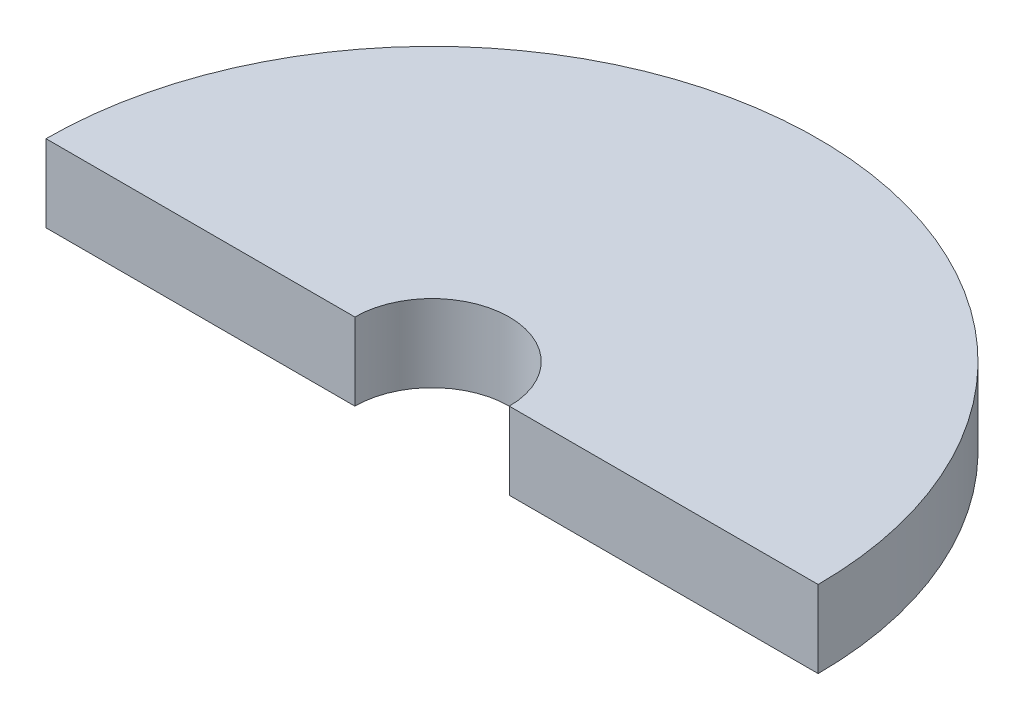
ISO-10303-21;
HEADER;
FILE_DESCRIPTION(('STEP AP214'),'2;1');
FILE_NAME('part.step','',(''),(''),'','','');
FILE_SCHEMA(('AUTOMOTIVE_DESIGN { 1 0 10303 214 1 1 1 1 }'));
ENDSEC;
DATA;
#1=APPLICATION_CONTEXT('core data for automotive mechanical design processes');
#2=APPLICATION_PROTOCOL_DEFINITION('international standard','automotive_design',2000,#1);
#3=PRODUCT_CONTEXT('',#1,'mechanical');
#4=PRODUCT('Part','Part','',(#3));
#5=PRODUCT_RELATED_PRODUCT_CATEGORY('part','',(#4));
#6=PRODUCT_DEFINITION_FORMATION('','',#4);
#7=PRODUCT_DEFINITION_CONTEXT('part definition',#1,'design');
#8=PRODUCT_DEFINITION('design','',#6,#7);
#9=PRODUCT_DEFINITION_SHAPE('','',#8);
#10=(LENGTH_UNIT() NAMED_UNIT(*) SI_UNIT(.MILLI.,.METRE.));
#11=(NAMED_UNIT(*) PLANE_ANGLE_UNIT() SI_UNIT($,.RADIAN.));
#12=(NAMED_UNIT(*) SI_UNIT($,.STERADIAN.) SOLID_ANGLE_UNIT());
#13=UNCERTAINTY_MEASURE_WITH_UNIT(LENGTH_MEASURE(1.E-05),#10,'distance_accuracy_value','');
#14=(GEOMETRIC_REPRESENTATION_CONTEXT(3) GLOBAL_UNCERTAINTY_ASSIGNED_CONTEXT((#13)) GLOBAL_UNIT_ASSIGNED_CONTEXT((#10,
#11,#12)) REPRESENTATION_CONTEXT('',''));
#15=CARTESIAN_POINT('',(0.,0.,0.));
#16=DIRECTION('',(0.,0.,1.));
#17=DIRECTION('',(1.,0.,0.));
#18=AXIS2_PLACEMENT_3D('',#15,#16,#17);
#19=CARTESIAN_POINT('',(0.,1.,0.));
#20=DIRECTION('',(0.,1.,0.));
#21=DIRECTION('',(0.,0.,1.));
#22=AXIS2_PLACEMENT_3D('',#19,#20,#21);
#23=PLANE('',#22);
#24=CARTESIAN_POINT('',(0.,1.,0.));
#25=DIRECTION('',(0.,1.,0.));
#26=DIRECTION('',(0.,0.,1.));
#27=AXIS2_PLACEMENT_3D('',#24,#25,#26);
#28=CIRCLE('',#27,5.);
#29=CARTESIAN_POINT('',(5.,1.,0.));
#30=VERTEX_POINT('',#29);
#31=CARTESIAN_POINT('',(-4.99999999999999,1.,0.));
#32=VERTEX_POINT('',#31);
#33=EDGE_CURVE('E85',#30,#32,#28,.T.);
#34=ORIENTED_EDGE('',*,*,#33,.T.);
#35=DIRECTION('',(1.,0.,0.));
#36=VECTOR('',#35,1.);
#37=CARTESIAN_POINT('',(0.,1.,0.));
#38=LINE('',#37,#36);
#39=CARTESIAN_POINT('',(-1.,1.,0.));
#40=VERTEX_POINT('',#39);
#41=EDGE_CURVE('E100',#32,#40,#38,.T.);
#42=ORIENTED_EDGE('',*,*,#41,.T.);
#43=CARTESIAN_POINT('',(0.,1.,0.));
#44=DIRECTION('',(0.,1.,0.));
#45=DIRECTION('',(0.,0.,1.));
#46=AXIS2_PLACEMENT_3D('',#43,#44,#45);
#47=CIRCLE('',#46,1.);
#48=CARTESIAN_POINT('',(1.,1.,0.));
#49=VERTEX_POINT('',#48);
#50=EDGE_CURVE('E88',#49,#40,#47,.T.);
#51=ORIENTED_EDGE('',*,*,#50,.F.);
#52=EDGE_CURVE('E53',#49,#30,#38,.T.);
#53=ORIENTED_EDGE('',*,*,#52,.T.);
#54=EDGE_LOOP('',(#34,#42,#51,#53));
#55=FACE_BOUND('',#54,.T.);
#56=ADVANCED_FACE('F31',(#55),#23,.T.);
#57=CARTESIAN_POINT('',(0.,0.,0.));
#58=DIRECTION('',(0.,1.,0.));
#59=DIRECTION('',(0.,0.,1.));
#60=AXIS2_PLACEMENT_3D('',#57,#58,#59);
#61=PLANE('',#60);
#62=DIRECTION('',(-1.,0.,0.));
#63=VECTOR('',#62,1.);
#64=CARTESIAN_POINT('',(0.,0.,0.));
#65=LINE('',#64,#63);
#66=CARTESIAN_POINT('',(-1.,0.,0.));
#67=VERTEX_POINT('',#66);
#68=CARTESIAN_POINT('',(-4.99999999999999,0.,0.));
#69=VERTEX_POINT('',#68);
#70=EDGE_CURVE('E46',#67,#69,#65,.T.);
#71=ORIENTED_EDGE('',*,*,#70,.T.);
#72=CARTESIAN_POINT('',(0.,0.,0.));
#73=DIRECTION('',(0.,1.,0.));
#74=DIRECTION('',(0.,0.,1.));
#75=AXIS2_PLACEMENT_3D('',#72,#73,#74);
#76=CIRCLE('',#75,5.);
#77=CARTESIAN_POINT('',(5.,0.,0.));
#78=VERTEX_POINT('',#77);
#79=EDGE_CURVE('E83',#78,#69,#76,.T.);
#80=ORIENTED_EDGE('',*,*,#79,.F.);
#81=CARTESIAN_POINT('',(1.,0.,0.));
#82=VERTEX_POINT('',#81);
#83=EDGE_CURVE('E69',#78,#82,#65,.T.);
#84=ORIENTED_EDGE('',*,*,#83,.T.);
#85=CARTESIAN_POINT('',(0.,0.,0.));
#86=DIRECTION('',(0.,1.,0.));
#87=DIRECTION('',(0.,0.,1.));
#88=AXIS2_PLACEMENT_3D('',#85,#86,#87);
#89=CIRCLE('',#88,1.);
#90=EDGE_CURVE('E92',#82,#67,#89,.T.);
#91=ORIENTED_EDGE('',*,*,#90,.T.);
#92=EDGE_LOOP('',(#71,#80,#84,#91));
#93=FACE_BOUND('',#92,.T.);
#94=ADVANCED_FACE('F87',(#93),#61,.F.);
#95=CARTESIAN_POINT('',(0.,1.,0.));
#96=DIRECTION('',(0.,-1.,0.));
#97=DIRECTION('',(0.,0.,-1.));
#98=AXIS2_PLACEMENT_3D('',#95,#96,#97);
#99=CYLINDRICAL_SURFACE('',#98,5.);
#100=DIRECTION('',(0.,1.,0.));
#101=VECTOR('',#100,1.);
#102=CARTESIAN_POINT('',(-4.99999999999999,0.,0.));
#103=LINE('',#102,#101);
#104=EDGE_CURVE('E77',#69,#32,#103,.T.);
#105=ORIENTED_EDGE('',*,*,#104,.T.);
#106=ORIENTED_EDGE('',*,*,#33,.F.);
#107=DIRECTION('',(0.,1.,0.));
#108=VECTOR('',#107,1.);
#109=CARTESIAN_POINT('',(5.,0.,0.));
#110=LINE('',#109,#108);
#111=EDGE_CURVE('E72',#78,#30,#110,.T.);
#112=ORIENTED_EDGE('',*,*,#111,.F.);
#113=ORIENTED_EDGE('',*,*,#79,.T.);
#114=EDGE_LOOP('',(#105,#106,#112,#113));
#115=FACE_BOUND('',#114,.T.);
#116=ADVANCED_FACE('F33',(#115),#99,.T.);
#117=CARTESIAN_POINT('',(0.,1.,0.));
#118=DIRECTION('',(0.,-1.,0.));
#119=DIRECTION('',(0.,0.,-1.));
#120=AXIS2_PLACEMENT_3D('',#117,#118,#119);
#121=CYLINDRICAL_SURFACE('',#120,1.);
#122=ORIENTED_EDGE('',*,*,#50,.T.);
#123=DIRECTION('',(0.,-1.,0.));
#124=VECTOR('',#123,1.);
#125=CARTESIAN_POINT('',(-1.,1.,0.));
#126=LINE('',#125,#124);
#127=EDGE_CURVE('E11',#40,#67,#126,.T.);
#128=ORIENTED_EDGE('',*,*,#127,.T.);
#129=ORIENTED_EDGE('',*,*,#90,.F.);
#130=DIRECTION('',(0.,-1.,0.));
#131=VECTOR('',#130,1.);
#132=CARTESIAN_POINT('',(1.,1.,0.));
#133=LINE('',#132,#131);
#134=EDGE_CURVE('E39',#82,#49,#133,.F.);
#135=ORIENTED_EDGE('',*,*,#134,.T.);
#136=EDGE_LOOP('',(#122,#128,#129,#135));
#137=FACE_BOUND('',#136,.T.);
#138=ADVANCED_FACE('F97',(#137),#121,.F.);
#139=CARTESIAN_POINT('',(0.,1.,0.));
#140=DIRECTION('',(0.,0.,1.));
#141=DIRECTION('',(1.,0.,0.));
#142=AXIS2_PLACEMENT_3D('',#139,#140,#141);
#143=PLANE('',#142);
#144=ORIENTED_EDGE('',*,*,#83,.F.);
#145=ORIENTED_EDGE('',*,*,#111,.T.);
#146=ORIENTED_EDGE('',*,*,#52,.F.);
#147=ORIENTED_EDGE('',*,*,#134,.F.);
#148=EDGE_LOOP('',(#144,#145,#146,#147));
#149=FACE_BOUND('',#148,.T.);
#150=ADVANCED_FACE('F71',(#149),#143,.T.);
#151=ORIENTED_EDGE('',*,*,#41,.F.);
#152=ORIENTED_EDGE('',*,*,#104,.F.);
#153=ORIENTED_EDGE('',*,*,#70,.F.);
#154=ORIENTED_EDGE('',*,*,#127,.F.);
#155=EDGE_LOOP('',(#151,#152,#153,#154));
#156=FACE_BOUND('',#155,.T.);
#157=ADVANCED_FACE('F103',(#156),#143,.T.);
#158=CLOSED_SHELL('',(#56,#94,#116,#138,#150,#157));
#159=MANIFOLD_SOLID_BREP('B2',#158);
#160=ADVANCED_BREP_SHAPE_REPRESENTATION('',(#18,#159),#14);
#161=SHAPE_DEFINITION_REPRESENTATION(#9,#160);
ENDSEC;
END-ISO-10303-21;
